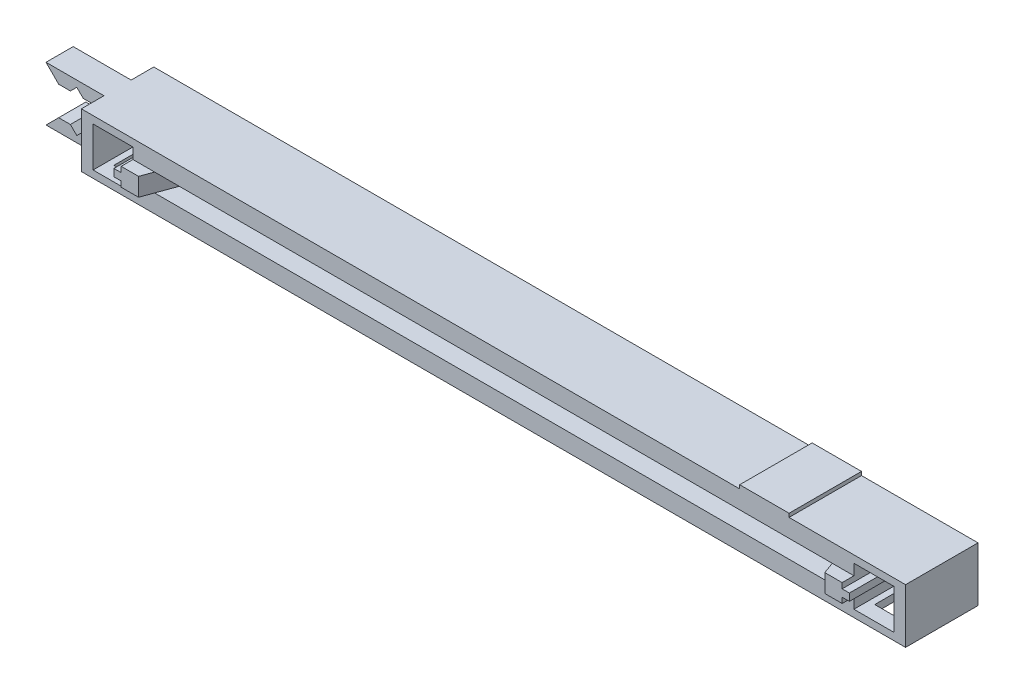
from build123d import *

# Parameters (mm, degrees)
SKETCH_1_W            = 35
SKETCH_1_H            = 30
EXTRUDE_1_DEPTH       = 20
SKETCH_2_W            = 15
SKETCH_2_H            = 15
EXTRUDE_2_DEPTH       = 385
SKETCH_3_W            = 40
SKETCH_3_H            = 30
EXTRUDE_3_DEPTH       = 35
SKETCH_4_W            = 22
SKETCH_4_H            = 22
CUT_EXTRUDE_1_DEPTH   = 40
SKETCH_5_W            = 22
SKETCH_5_H            = 22
CUT_EXTRUDE_2_DEPTH   = 40
SKETCH_7_W            = 15
SKETCH_7_H            = 24
CUT_EXTRUDE_4_DEPTH   = 10
EXTRUDE_4_DEPTH       = 5
MIRROR_2_COPY_1_DEPTH = 5
EXTRUDE_5_DEPTH       = 7.5
SKETCH_10_W           = 8
SKETCH_10_H           = 4
EXTRUDE_6_DEPTH       = 53
EXTRUDE_7_REACH       = 455.025
EXTRUDE_8_REACH       = 455.025
SKETCH_12_W           = 14.881049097
SKETCH_12_H           = 1.5
SKETCH_13_W           = 27.255143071
SKETCH_13_H           = 40
EXTRUDE_9_DEPTH       = 2
SKETCH_14_W           = 43.67235449
SKETCH_14_H           = 38.971714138
CUT_EXTRUDE_5_DEPTH   = 472.036357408


with BuildPart() as part:
    # Sketch 1 → Extrude 1 (new, symmetric)
    with BuildSketch(Plane.XY):
        Rectangle(SKETCH_1_W, SKETCH_1_H)
    extrude(amount=EXTRUDE_1_DEPTH, both=True)

    # Sketch 2 → Extrude 2 (add)
    with BuildSketch(Plane.ZY.offset(17.5)):
        Rectangle(SKETCH_2_W, SKETCH_2_H)
    extrude(amount=EXTRUDE_2_DEPTH)

    # Sketch 3 → Extrude 3 (add)
    with BuildSketch(Plane.ZY.offset(402.5)):
        Rectangle(SKETCH_3_W, SKETCH_3_H)
    extrude(amount=EXTRUDE_3_DEPTH)

    # Sketch 4 → Cut-Extrude 1 (cut)
    with BuildSketch(Plane.XY.offset(20)):
        Rectangle(SKETCH_4_W, SKETCH_4_H)
    extrude(amount=-CUT_EXTRUDE_1_DEPTH, mode=Mode.SUBTRACT)

    # Sketch 5 → Cut-Extrude 2 (cut)
    with BuildSketch(Plane.XY.offset(20)):
        with Locations((-420, 0)):
            Rectangle(SKETCH_5_W, SKETCH_5_H)
    extrude(amount=-CUT_EXTRUDE_2_DEPTH, mode=Mode.SUBTRACT)

    # Sketch 7 → Cut-Extrude 4 (cut)
    with BuildSketch(Plane.XZ.offset(15)):
        with Locations((-420, 0)):
            Rectangle(SKETCH_7_W, SKETCH_7_H)
    cut_extrude_4 = extrude(amount=-CUT_EXTRUDE_4_DEPTH, mode=Mode.SUBTRACT)

    # Sketch 8 → Extrude 4 (add, symmetric)
    with BuildSketch(Plane(origin=(0, 0, 0), x_dir=(1, 0, 0), z_dir=(0, 1, 0))):
        Polygon((-392.5, 7.5), (-399.415434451, 26.5), (-409, 26.5), (-409, 20), (-402.5, 20), (-402.5, 7.5), align=None)
    extrude_4 = extrude(amount=EXTRUDE_4_DEPTH, both=True)

    # Mirror 1: Extrude 4 across plane
    add(extrude_4.mirror(Plane.XY))

    # Mirror 2: Cut-Extrude 4, Extrude 4 across plane
    add(cut_extrude_4.mirror(Plane(origin=(-210, 0, 0), x_dir=(0, 0, 1), z_dir=(1, 0, 0))), mode=Mode.SUBTRACT)
    add(extrude_4.mirror(Plane(origin=(-210, 0, 0), x_dir=(0, 0, 1), z_dir=(1, 0, 0))))

    # Mirror 2 copy 1 sketch → Mirror 2 copy 1 (add, symmetric)
    with BuildSketch(Plane(origin=(-420, 0, 0), x_dir=(-1, 0, 0), z_dir=(0, 1, 0))):
        Polygon((-392.5, 7.5), (-399.415434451, 26.5), (-409, 26.5), (-409, 20), (-402.5, 20), (-402.5, 7.5), align=None)
    extrude(amount=MIRROR_2_COPY_1_DEPTH, both=True)

    # Sketch 9 → Extrude 5 (add, symmetric)
    with BuildSketch(Plane.XY):
        Polygon((-437.5, -15), (-469.5, -15), (-462.5, -8), (-456.035533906, -8), (-452.5, -11.535533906), (-448.964466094, -8), (-444.5, -8), (-441.5, -5), (-437.5, -5), align=None)
        Polygon((-437.5, 5), (-437.5, 15), (-469.5, 15), (-462.5, 8), (-456.035533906, 8), (-452.5, 11.535533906), (-448.964466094, 8), (-444.5, 8), (-441.5, 5), align=None)
    extrude_5 = extrude(amount=EXTRUDE_5_DEPTH, both=True)

    # Sketch 10 → Extrude 6 (add)
    with BuildSketch(Plane.XY.offset(26.5)):
        with Locations((-409, 0)):
            Rectangle(SKETCH_10_W, SKETCH_10_H)
    extrude_6 = extrude(amount=-EXTRUDE_6_DEPTH)

    # Mirror 3: Extrude 5, Extrude 6 across plane
    add(extrude_5.mirror(Plane(origin=(-210, 0, 0), x_dir=(0, 0, 1), z_dir=(1, 0, 0))))
    add(extrude_6.mirror(Plane(origin=(-210, 0, 0), x_dir=(0, 0, 1), z_dir=(1, 0, 0))))

    # Extrude 7: up to this face of the body (flat: up to its plane)
    extrude_7_end = Plane(part.part.faces().sort_by_distance((-402.5, -10.387931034, 0))[0])
    # Sketch 11 → Extrude 7 (add, up to the picked face)
    with BuildSketch(Plane.ZY.offset(17.5), mode=Mode.PRIVATE) as extrude_7_sk1:
        Polygon((-20, -15), (20, -15), (20, -5), (18.5, -5), (18.5, -11), (18.5, -13.5), (-18.5, -13.5), (-18.5, -11), (-18.5, -5), (-20, -5), align=None)
    extrude_7_tool1 = split(extrude(extrude_7_sk1.sketch, amount=EXTRUDE_7_REACH, mode=Mode.PRIVATE), bisect_by=extrude_7_end, keep=Keep.BOTH, mode=Mode.PRIVATE)
    # Sketch 11 → Extrude 7 (add, up to the picked face)
    with BuildSketch(Plane.ZY.offset(17.5), mode=Mode.PRIVATE) as extrude_7_sk2:
        Polygon((18.5, -13.5), (18.5, -11), (7.5, -5), (7.5, -7.5), align=None)
    extrude_7_tool2 = split(extrude(extrude_7_sk2.sketch, amount=EXTRUDE_7_REACH, mode=Mode.PRIVATE), bisect_by=extrude_7_end, keep=Keep.BOTH, mode=Mode.PRIVATE)
    # Sketch 11 → Extrude 7 (add, up to the picked face)
    with BuildSketch(Plane.ZY.offset(17.5), mode=Mode.PRIVATE) as extrude_7_sk3:
        Polygon((-7.5, -5), (-18.5, -11), (-18.5, -13.5), (-7.5, -7.5), align=None)
    extrude_7_tool3 = split(extrude(extrude_7_sk3.sketch, amount=EXTRUDE_7_REACH, mode=Mode.PRIVATE), bisect_by=extrude_7_end, keep=Keep.BOTH, mode=Mode.PRIVATE)
    # Sketch 11 → Extrude 7 (add, up to the picked face)
    with BuildSketch(Plane.ZY.offset(17.5), mode=Mode.PRIVATE) as extrude_7_sk4:
        Polygon((7.5, 5), (18.5, 11), (18.5, 13.5), (7.5, 7.5), align=None)
    extrude_7_tool4 = split(extrude(extrude_7_sk4.sketch, amount=EXTRUDE_7_REACH, mode=Mode.PRIVATE), bisect_by=extrude_7_end, keep=Keep.BOTH, mode=Mode.PRIVATE)
    # Sketch 11 → Extrude 7 (add, up to the picked face)
    with BuildSketch(Plane.ZY.offset(17.5), mode=Mode.PRIVATE) as extrude_7_sk5:
        Polygon((18.5, 5), (18.5, 13.5), (-18.5, 13.5), (-18.5, 5), (-20, 5), (-20, 15), (20, 15), (20, 5), align=None)
    extrude_7_tool5 = split(extrude(extrude_7_sk5.sketch, amount=EXTRUDE_7_REACH, mode=Mode.PRIVATE), bisect_by=extrude_7_end, keep=Keep.BOTH, mode=Mode.PRIVATE)
    # Sketch 11 → Extrude 7 (add, up to the picked face)
    with BuildSketch(Plane.ZY.offset(17.5), mode=Mode.PRIVATE) as extrude_7_sk6:
        Polygon((-7.5, 7.5), (-18.5, 13.5), (-18.5, 11), (-7.5, 5), align=None)
    extrude_7_tool6 = split(extrude(extrude_7_sk6.sketch, amount=EXTRUDE_7_REACH, mode=Mode.PRIVATE), bisect_by=extrude_7_end, keep=Keep.BOTH, mode=Mode.PRIVATE)
    add(extrude_7_tool1.solids().sort_by(Axis((-17.5, -14.587689, 0), (-1, 0, 0)))[0])
    add(extrude_7_tool2.solids().sort_by(Axis((-17.5, -9.25, 13), (-1, 0, 0)))[0])
    add(extrude_7_tool3.solids().sort_by(Axis((-17.5, -9.25, -13), (-1, 0, 0)))[0])
    add(extrude_7_tool4.solids().sort_by(Axis((-17.5, 9.25, 13), (-1, 0, 0)))[0])
    add(extrude_7_tool5.solids().sort_by(Axis((-17.5, 9.25, 18.912311), (-1, 0, 0)))[0])
    add(extrude_7_tool6.solids().sort_by(Axis((-17.5, 9.25, -13), (-1, 0, 0)))[0])

    # Sketch 12 → Extrude 8 (add, up to next)
    with BuildSketch(Plane(origin=(-402.5, 0, 0), x_dir=(0, 0, -1), z_dir=(1, 0, 0)), mode=Mode.PRIVATE) as extrude_8_sk1:
        with Locations((-12.559475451, 5.75)):
            Rectangle(SKETCH_12_W, SKETCH_12_H)
    extrude_8_tool1 = extrude(extrude_8_sk1.sketch, amount=EXTRUDE_8_REACH, mode=Mode.PRIVATE) - part.part
    # Sketch 12 → Extrude 8 (add, up to next)
    with BuildSketch(Plane(origin=(-402.5, 0, 0), x_dir=(0, 0, -1), z_dir=(1, 0, 0)), mode=Mode.PRIVATE) as extrude_8_sk2:
        with Locations((12.559475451, 5.75)):
            Rectangle(SKETCH_12_W, SKETCH_12_H)
    extrude_8_tool2 = extrude(extrude_8_sk2.sketch, amount=EXTRUDE_8_REACH, mode=Mode.PRIVATE) - part.part
    # Sketch 12 → Extrude 8 (add, up to next)
    with BuildSketch(Plane(origin=(-402.5, 0, 0), x_dir=(0, 0, -1), z_dir=(1, 0, 0)), mode=Mode.PRIVATE) as extrude_8_sk3:
        with Locations((12.559475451, -5.75)):
            Rectangle(SKETCH_12_W, SKETCH_12_H)
    extrude_8_tool3 = extrude(extrude_8_sk3.sketch, amount=EXTRUDE_8_REACH, mode=Mode.PRIVATE) - part.part
    # Sketch 12 → Extrude 8 (add, up to next)
    with BuildSketch(Plane(origin=(-402.5, 0, 0), x_dir=(0, 0, -1), z_dir=(1, 0, 0)), mode=Mode.PRIVATE) as extrude_8_sk4:
        with Locations((-12.559475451, -5.75)):
            Rectangle(SKETCH_12_W, SKETCH_12_H)
    extrude_8_tool4 = extrude(extrude_8_sk4.sketch, amount=EXTRUDE_8_REACH, mode=Mode.PRIVATE) - part.part
    add(extrude_8_tool1.solids().sort_by_distance((-402.5, 5.75, 12.559475))[0])
    add(extrude_8_tool2.solids().sort_by_distance((-402.5, 5.75, -12.559475))[0])
    add(extrude_8_tool3.solids().sort_by_distance((-402.5, -5.75, -12.559475))[0])
    add(extrude_8_tool4.solids().sort_by_distance((-402.5, -5.75, 12.559475))[0])

    # Sketch 13 → Extrude 9 (add)
    with BuildSketch(Plane(origin=(0, 15, 0), x_dir=(1, 0, 0), z_dir=(0, 1, 0))):
        with Locations((-60.431212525, 0)):
            Rectangle(SKETCH_13_W, SKETCH_13_H)
    extrude(amount=EXTRUDE_9_DEPTH)

    # Sketch 14 → Cut-Extrude 5 (cut, through all)
    with BuildSketch(Plane.XY.offset(7.5)):
        with Locations((39.336177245, -4.485857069)):
            Rectangle(SKETCH_14_W, SKETCH_14_H)
    extrude(amount=-CUT_EXTRUDE_5_DEPTH, mode=Mode.SUBTRACT)


solid = part.part
